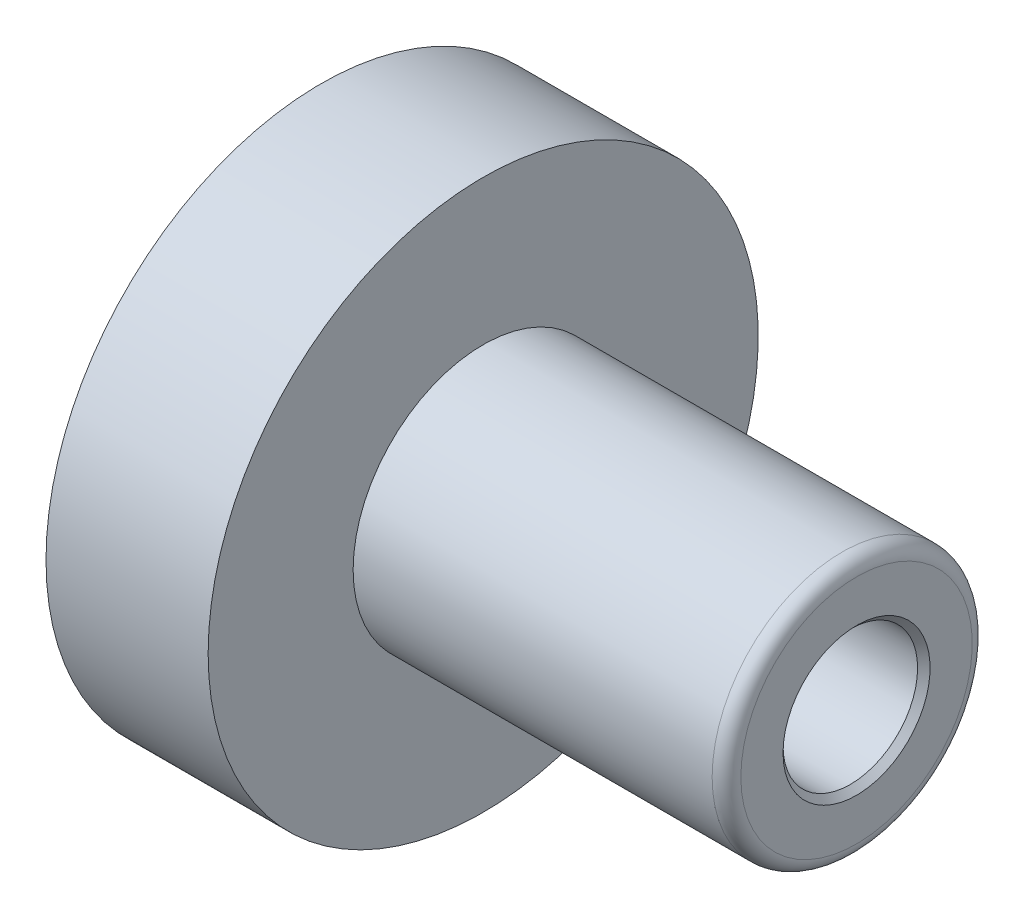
ISO-10303-21;
HEADER;
FILE_DESCRIPTION(('STEP AP214'),'2;1');
FILE_NAME('part.step','',(''),(''),'','','');
FILE_SCHEMA(('AUTOMOTIVE_DESIGN { 1 0 10303 214 1 1 1 1 }'));
ENDSEC;
DATA;
#1=APPLICATION_CONTEXT('core data for automotive mechanical design processes');
#2=APPLICATION_PROTOCOL_DEFINITION('international standard','automotive_design',2000,#1);
#3=PRODUCT_CONTEXT('',#1,'mechanical');
#4=PRODUCT('Part','Part','',(#3));
#5=PRODUCT_RELATED_PRODUCT_CATEGORY('part','',(#4));
#6=PRODUCT_DEFINITION_FORMATION('','',#4);
#7=PRODUCT_DEFINITION_CONTEXT('part definition',#1,'design');
#8=PRODUCT_DEFINITION('design','',#6,#7);
#9=PRODUCT_DEFINITION_SHAPE('','',#8);
#10=(LENGTH_UNIT() NAMED_UNIT(*) SI_UNIT(.MILLI.,.METRE.));
#11=(NAMED_UNIT(*) PLANE_ANGLE_UNIT() SI_UNIT($,.RADIAN.));
#12=(NAMED_UNIT(*) SI_UNIT($,.STERADIAN.) SOLID_ANGLE_UNIT());
#13=UNCERTAINTY_MEASURE_WITH_UNIT(LENGTH_MEASURE(1.E-05),#10,'distance_accuracy_value','');
#14=(GEOMETRIC_REPRESENTATION_CONTEXT(3) GLOBAL_UNCERTAINTY_ASSIGNED_CONTEXT((#13)) GLOBAL_UNIT_ASSIGNED_CONTEXT((#10,
#11,#12)) REPRESENTATION_CONTEXT('',''));
#15=CARTESIAN_POINT('',(0.,0.,0.));
#16=DIRECTION('',(0.,0.,1.));
#17=DIRECTION('',(1.,0.,0.));
#18=AXIS2_PLACEMENT_3D('',#15,#16,#17);
#19=CARTESIAN_POINT('',(0.,0.,0.));
#20=DIRECTION('',(-1.,0.,0.));
#21=DIRECTION('',(0.,0.,1.));
#22=AXIS2_PLACEMENT_3D('',#19,#20,#21);
#23=CYLINDRICAL_SURFACE('',#22,9.906);
#24=CARTESIAN_POINT('',(33.3502,0.,0.));
#25=DIRECTION('',(-1.,0.,0.));
#26=DIRECTION('',(0.,0.,1.));
#27=AXIS2_PLACEMENT_3D('',#24,#25,#26);
#28=CIRCLE('',#27,9.906);
#29=CARTESIAN_POINT('',(33.3502,0.,9.906));
#30=VERTEX_POINT('',#29);
#31=EDGE_CURVE('E42',#30,#30,#28,.T.);
#32=ORIENTED_EDGE('',*,*,#31,.F.);
#33=EDGE_LOOP('',(#32));
#34=FACE_BOUND('',#33,.T.);
#35=CARTESIAN_POINT('',(0.,0.,0.));
#36=DIRECTION('',(-1.,0.,0.));
#37=DIRECTION('',(0.,0.,1.));
#38=AXIS2_PLACEMENT_3D('',#35,#36,#37);
#39=CIRCLE('',#38,9.906);
#40=CARTESIAN_POINT('',(0.,0.,9.906));
#41=VERTEX_POINT('',#40);
#42=EDGE_CURVE('E63',#41,#41,#39,.T.);
#43=ORIENTED_EDGE('',*,*,#42,.T.);
#44=EDGE_LOOP('',(#43));
#45=FACE_BOUND('',#44,.T.);
#46=ADVANCED_FACE('F31',(#34,#45),#23,.F.);
#47=CARTESIAN_POINT('',(33.3502,9.906,0.));
#48=DIRECTION('',(1.,0.,0.));
#49=DIRECTION('',(0.,0.,-1.));
#50=AXIS2_PLACEMENT_3D('',#47,#48,#49);
#51=PLANE('',#50);
#52=ORIENTED_EDGE('',*,*,#31,.T.);
#53=EDGE_LOOP('',(#52));
#54=FACE_BOUND('',#53,.T.);
#55=ADVANCED_FACE('F97',(#54),#51,.F.);
#56=CARTESIAN_POINT('',(58.7248,12.6873,0.));
#57=DIRECTION('',(-1.,0.,0.));
#58=DIRECTION('',(0.,0.,1.));
#59=AXIS2_PLACEMENT_3D('',#56,#57,#58);
#60=PLANE('',#59);
#61=CARTESIAN_POINT('',(58.7248,0.,0.));
#62=DIRECTION('',(-1.,0.,0.));
#63=DIRECTION('',(0.,0.,1.));
#64=AXIS2_PLACEMENT_3D('',#61,#62,#63);
#65=CIRCLE('',#64,8.0645);
#66=CARTESIAN_POINT('',(58.7248,0.,8.0645));
#67=VERTEX_POINT('',#66);
#68=EDGE_CURVE('E10',#67,#67,#65,.T.);
#69=ORIENTED_EDGE('',*,*,#68,.T.);
#70=EDGE_LOOP('',(#69));
#71=FACE_BOUND('',#70,.T.);
#72=CARTESIAN_POINT('',(58.7248,0.,0.));
#73=DIRECTION('',(-1.,0.,0.));
#74=DIRECTION('',(0.,0.,1.));
#75=AXIS2_PLACEMENT_3D('',#72,#73,#74);
#76=CIRCLE('',#75,12.6873);
#77=CARTESIAN_POINT('',(58.7248,0.,12.6873));
#78=VERTEX_POINT('',#77);
#79=EDGE_CURVE('E46',#78,#78,#76,.T.);
#80=ORIENTED_EDGE('',*,*,#79,.F.);
#81=EDGE_LOOP('',(#80));
#82=FACE_BOUND('',#81,.T.);
#83=ADVANCED_FACE('F102',(#71,#82),#60,.F.);
#84=CARTESIAN_POINT('',(57.15,0.,0.));
#85=DIRECTION('',(-1.,0.,0.));
#86=DIRECTION('',(0.,0.,1.));
#87=AXIS2_PLACEMENT_3D('',#84,#85,#86);
#88=TOROIDAL_SURFACE('',#87,12.6873,1.5748);
#89=CARTESIAN_POINT('',(57.15,0.,0.));
#90=DIRECTION('',(-1.,0.,0.));
#91=DIRECTION('',(0.,0.,1.));
#92=AXIS2_PLACEMENT_3D('',#89,#90,#91);
#93=CIRCLE('',#92,14.2621);
#94=CARTESIAN_POINT('',(57.15,0.,14.2621));
#95=VERTEX_POINT('',#94);
#96=EDGE_CURVE('E51',#95,#95,#93,.T.);
#97=ORIENTED_EDGE('',*,*,#96,.F.);
#98=EDGE_LOOP('',(#97));
#99=FACE_BOUND('',#98,.T.);
#100=ORIENTED_EDGE('',*,*,#79,.T.);
#101=EDGE_LOOP('',(#100));
#102=FACE_BOUND('',#101,.T.);
#103=ADVANCED_FACE('F110',(#99,#102),#88,.T.);
#104=CARTESIAN_POINT('',(0.,0.,0.));
#105=DIRECTION('',(-1.,0.,0.));
#106=DIRECTION('',(0.,0.,1.));
#107=AXIS2_PLACEMENT_3D('',#104,#105,#106);
#108=CYLINDRICAL_SURFACE('',#107,14.2621);
#109=CARTESIAN_POINT('',(17.78,0.,0.));
#110=DIRECTION('',(-1.,0.,0.));
#111=DIRECTION('',(0.,0.,1.));
#112=AXIS2_PLACEMENT_3D('',#109,#110,#111);
#113=CIRCLE('',#112,14.2621);
#114=CARTESIAN_POINT('',(17.78,0.,14.2621));
#115=VERTEX_POINT('',#114);
#116=EDGE_CURVE('E54',#115,#115,#113,.T.);
#117=ORIENTED_EDGE('',*,*,#116,.F.);
#118=EDGE_LOOP('',(#117));
#119=FACE_BOUND('',#118,.T.);
#120=ORIENTED_EDGE('',*,*,#96,.T.);
#121=EDGE_LOOP('',(#120));
#122=FACE_BOUND('',#121,.T.);
#123=ADVANCED_FACE('F113',(#119,#122),#108,.T.);
#124=CARTESIAN_POINT('',(17.78,30.1625,0.));
#125=DIRECTION('',(-1.,0.,0.));
#126=DIRECTION('',(0.,0.,1.));
#127=AXIS2_PLACEMENT_3D('',#124,#125,#126);
#128=PLANE('',#127);
#129=CARTESIAN_POINT('',(17.78,0.,0.));
#130=DIRECTION('',(-1.,0.,0.));
#131=DIRECTION('',(0.,0.,1.));
#132=AXIS2_PLACEMENT_3D('',#129,#130,#131);
#133=CIRCLE('',#132,30.1625);
#134=CARTESIAN_POINT('',(17.78,0.,30.1625));
#135=VERTEX_POINT('',#134);
#136=EDGE_CURVE('E57',#135,#135,#133,.T.);
#137=ORIENTED_EDGE('',*,*,#136,.F.);
#138=EDGE_LOOP('',(#137));
#139=FACE_BOUND('',#138,.T.);
#140=ORIENTED_EDGE('',*,*,#116,.T.);
#141=EDGE_LOOP('',(#140));
#142=FACE_BOUND('',#141,.T.);
#143=ADVANCED_FACE('F117',(#139,#142),#128,.F.);
#144=CARTESIAN_POINT('',(0.,0.,0.));
#145=DIRECTION('',(-1.,0.,0.));
#146=DIRECTION('',(0.,0.,1.));
#147=AXIS2_PLACEMENT_3D('',#144,#145,#146);
#148=CYLINDRICAL_SURFACE('',#147,30.1625);
#149=CARTESIAN_POINT('',(0.,0.,0.));
#150=DIRECTION('',(-1.,0.,0.));
#151=DIRECTION('',(0.,0.,1.));
#152=AXIS2_PLACEMENT_3D('',#149,#150,#151);
#153=CIRCLE('',#152,30.1625);
#154=CARTESIAN_POINT('',(0.,0.,30.1625));
#155=VERTEX_POINT('',#154);
#156=EDGE_CURVE('E60',#155,#155,#153,.T.);
#157=ORIENTED_EDGE('',*,*,#156,.F.);
#158=EDGE_LOOP('',(#157));
#159=FACE_BOUND('',#158,.T.);
#160=ORIENTED_EDGE('',*,*,#136,.T.);
#161=EDGE_LOOP('',(#160));
#162=FACE_BOUND('',#161,.T.);
#163=ADVANCED_FACE('F121',(#159,#162),#148,.T.);
#164=CARTESIAN_POINT('',(0.,9.906,0.));
#165=DIRECTION('',(1.,0.,0.));
#166=DIRECTION('',(0.,0.,-1.));
#167=AXIS2_PLACEMENT_3D('',#164,#165,#166);
#168=PLANE('',#167);
#169=CARTESIAN_POINT('',(0.,-19.939,0.));
#170=DIRECTION('',(-1.,0.,0.));
#171=DIRECTION('',(0.,0.,-1.));
#172=AXIS2_PLACEMENT_3D('',#169,#170,#171);
#173=CIRCLE('',#172,3.2004);
#174=CARTESIAN_POINT('',(0.,-19.939,-3.2004));
#175=VERTEX_POINT('',#174);
#176=EDGE_CURVE('E73',#175,#175,#173,.T.);
#177=ORIENTED_EDGE('',*,*,#176,.F.);
#178=EDGE_LOOP('',(#177));
#179=FACE_BOUND('',#178,.T.);
#180=CARTESIAN_POINT('',(0.,19.939,0.));
#181=DIRECTION('',(-1.,0.,0.));
#182=DIRECTION('',(0.,0.,1.));
#183=AXIS2_PLACEMENT_3D('',#180,#181,#182);
#184=CIRCLE('',#183,3.2004);
#185=CARTESIAN_POINT('',(0.,19.939,3.2004));
#186=VERTEX_POINT('',#185);
#187=EDGE_CURVE('E67',#186,#186,#184,.T.);
#188=ORIENTED_EDGE('',*,*,#187,.F.);
#189=EDGE_LOOP('',(#188));
#190=FACE_BOUND('',#189,.T.);
#191=ORIENTED_EDGE('',*,*,#42,.F.);
#192=EDGE_LOOP('',(#191));
#193=FACE_BOUND('',#192,.T.);
#194=ORIENTED_EDGE('',*,*,#156,.T.);
#195=EDGE_LOOP('',(#194));
#196=FACE_BOUND('',#195,.T.);
#197=ADVANCED_FACE('F125',(#179,#190,#193,#196),#168,.F.);
#198=CARTESIAN_POINT('',(7.9502,19.939,0.));
#199=DIRECTION('',(-1.,0.,0.));
#200=DIRECTION('',(0.,0.,1.));
#201=AXIS2_PLACEMENT_3D('',#198,#199,#200);
#202=CYLINDRICAL_SURFACE('',#201,3.2004);
#203=CARTESIAN_POINT('',(7.9502,19.939,0.));
#204=DIRECTION('',(-1.,0.,0.));
#205=DIRECTION('',(0.,0.,1.));
#206=AXIS2_PLACEMENT_3D('',#203,#204,#205);
#207=CIRCLE('',#206,3.2004);
#208=CARTESIAN_POINT('',(7.9502,19.939,3.2004));
#209=VERTEX_POINT('',#208);
#210=EDGE_CURVE('E66',#209,#209,#207,.T.);
#211=ORIENTED_EDGE('',*,*,#210,.F.);
#212=EDGE_LOOP('',(#211));
#213=FACE_BOUND('',#212,.T.);
#214=ORIENTED_EDGE('',*,*,#187,.T.);
#215=EDGE_LOOP('',(#214));
#216=FACE_BOUND('',#215,.T.);
#217=ADVANCED_FACE('F129',(#213,#216),#202,.F.);
#218=CARTESIAN_POINT('',(7.9502,19.939,0.));
#219=DIRECTION('',(-1.,0.,0.));
#220=DIRECTION('',(0.,0.,1.));
#221=AXIS2_PLACEMENT_3D('',#218,#219,#220);
#222=PLANE('',#221);
#223=ORIENTED_EDGE('',*,*,#210,.T.);
#224=EDGE_LOOP('',(#223));
#225=FACE_BOUND('',#224,.T.);
#226=ADVANCED_FACE('F133',(#225),#222,.T.);
#227=CARTESIAN_POINT('',(7.9502,-19.939,0.));
#228=DIRECTION('',(-1.,0.,0.));
#229=DIRECTION('',(0.,0.,1.));
#230=AXIS2_PLACEMENT_3D('',#227,#228,#229);
#231=CYLINDRICAL_SURFACE('',#230,3.2004);
#232=CARTESIAN_POINT('',(7.9502,-19.939,0.));
#233=DIRECTION('',(-1.,0.,0.));
#234=DIRECTION('',(0.,0.,-1.));
#235=AXIS2_PLACEMENT_3D('',#232,#233,#234);
#236=CIRCLE('',#235,3.2004);
#237=CARTESIAN_POINT('',(7.9502,-19.939,-3.2004));
#238=VERTEX_POINT('',#237);
#239=EDGE_CURVE('E70',#238,#238,#236,.T.);
#240=ORIENTED_EDGE('',*,*,#239,.F.);
#241=EDGE_LOOP('',(#240));
#242=FACE_BOUND('',#241,.T.);
#243=ORIENTED_EDGE('',*,*,#176,.T.);
#244=EDGE_LOOP('',(#243));
#245=FACE_BOUND('',#244,.T.);
#246=ADVANCED_FACE('F93',(#242,#245),#231,.F.);
#247=CARTESIAN_POINT('',(7.9502,-19.939,0.));
#248=DIRECTION('',(1.,0.,0.));
#249=DIRECTION('',(0.,0.,-1.));
#250=AXIS2_PLACEMENT_3D('',#247,#248,#249);
#251=PLANE('',#250);
#252=ORIENTED_EDGE('',*,*,#239,.T.);
#253=EDGE_LOOP('',(#252));
#254=FACE_BOUND('',#253,.T.);
#255=ADVANCED_FACE('F86',(#254),#251,.F.);
#256=CARTESIAN_POINT('',(35.9156,0.,0.));
#257=DIRECTION('',(1.,0.,0.));
#258=DIRECTION('',(0.,0.,-1.));
#259=AXIS2_PLACEMENT_3D('',#256,#257,#258);
#260=CYLINDRICAL_SURFACE('',#259,7.3787);
#261=CARTESIAN_POINT('',(58.039,0.,0.));
#262=DIRECTION('',(-1.,0.,0.));
#263=DIRECTION('',(0.,0.,1.));
#264=AXIS2_PLACEMENT_3D('',#261,#262,#263);
#265=CIRCLE('',#264,7.3787);
#266=CARTESIAN_POINT('',(58.039,0.,7.3787));
#267=VERTEX_POINT('',#266);
#268=EDGE_CURVE('E38',#267,#267,#265,.F.);
#269=ORIENTED_EDGE('',*,*,#268,.T.);
#270=EDGE_LOOP('',(#269));
#271=FACE_BOUND('',#270,.T.);
#272=CARTESIAN_POINT('',(35.9156,0.,0.));
#273=DIRECTION('',(1.,0.,0.));
#274=DIRECTION('',(0.,0.,-1.));
#275=AXIS2_PLACEMENT_3D('',#272,#273,#274);
#276=CIRCLE('',#275,7.3787);
#277=CARTESIAN_POINT('',(35.9156,0.,-7.3787));
#278=VERTEX_POINT('',#277);
#279=EDGE_CURVE('E76',#278,#278,#276,.T.);
#280=ORIENTED_EDGE('',*,*,#279,.F.);
#281=EDGE_LOOP('',(#280));
#282=FACE_BOUND('',#281,.T.);
#283=ADVANCED_FACE('F84',(#271,#282),#260,.F.);
#284=CARTESIAN_POINT('',(35.9156,0.,0.));
#285=DIRECTION('',(1.,0.,0.));
#286=DIRECTION('',(0.,0.,-1.));
#287=AXIS2_PLACEMENT_3D('',#284,#285,#286);
#288=PLANE('',#287);
#289=ORIENTED_EDGE('',*,*,#279,.T.);
#290=EDGE_LOOP('',(#289));
#291=FACE_BOUND('',#290,.T.);
#292=ADVANCED_FACE('F82',(#291),#288,.T.);
#293=CARTESIAN_POINT('',(58.039,0.,0.));
#294=DIRECTION('',(1.,0.,0.));
#295=DIRECTION('',(0.,0.,-1.));
#296=AXIS2_PLACEMENT_3D('',#293,#294,#295);
#297=CONICAL_SURFACE('',#296,7.3787,0.78539816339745);
#298=ORIENTED_EDGE('',*,*,#68,.F.);
#299=EDGE_LOOP('',(#298));
#300=FACE_BOUND('',#299,.T.);
#301=ORIENTED_EDGE('',*,*,#268,.F.);
#302=EDGE_LOOP('',(#301));
#303=FACE_BOUND('',#302,.T.);
#304=ADVANCED_FACE('F33',(#300,#303),#297,.F.);
#305=CLOSED_SHELL('',(#46,#55,#83,#103,#123,#143,#163,#197,#217,#226,#246,#255,#283,#292,#304));
#306=MANIFOLD_SOLID_BREP('B2',#305);
#307=ADVANCED_BREP_SHAPE_REPRESENTATION('',(#18,#306),#14);
#308=SHAPE_DEFINITION_REPRESENTATION(#9,#307);
ENDSEC;
END-ISO-10303-21;
